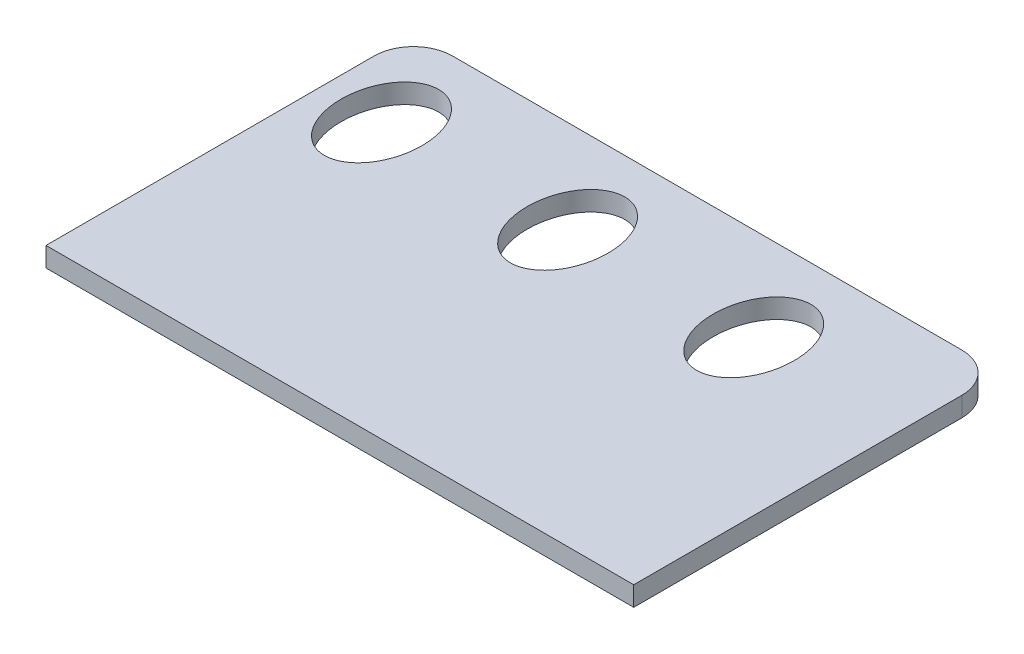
from build123d import *

# Parameters (mm, degrees)
SKIZZE1_RX                      = 11.66726189
SKIZZE1_RY                      = 8.25
AUFSATZ_LINEAR_AUSTRAGEN1_DEPTH = 4


with BuildPart() as part:
    # Skizze1 → Aufsatz-Linear austragen1 (new body)
    with BuildSketch(Plane(origin=(0, 0, 0), x_dir=(1, 0, 0), z_dir=(0, 1, 0))):
        with BuildLine():
            Line((-52, 37.5), (52, 37.5))
            ThreePointArc((52, 37.5), (57.656854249, 35.156854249), (60, 29.5))
            Line((60, 29.5), (60, -37.5))
            Line((60, -37.5), (-60, -37.5))
            Line((-60, -37.5), (-60, 29.5))
            ThreePointArc((-60, 29.5), (-57.656854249, 35.156854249), (-52, 37.5))
        make_face()
        with Locations(Location((-47.5, 18.5), (0, 0, -90))):
            Ellipse(SKIZZE1_RX, SKIZZE1_RY, mode=Mode.SUBTRACT)
        with Locations(Location((-9.5, 18.5), (0, 0, -90))):
            Ellipse(SKIZZE1_RX, SKIZZE1_RY, mode=Mode.SUBTRACT)
        with Locations(Location((28.5, 18.5), (0, 0, -90))):
            Ellipse(SKIZZE1_RX, SKIZZE1_RY, mode=Mode.SUBTRACT)
    extrude(amount=AUFSATZ_LINEAR_AUSTRAGEN1_DEPTH)


solid = part.part
